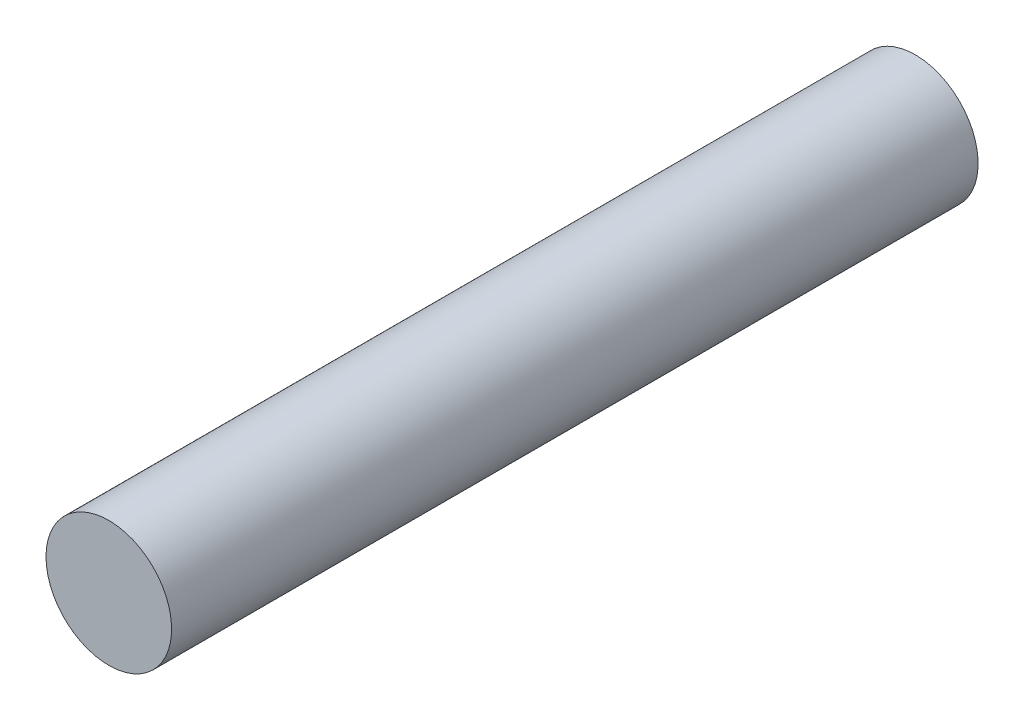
ISO-10303-21;
HEADER;
FILE_DESCRIPTION(('STEP AP214'),'2;1');
FILE_NAME('part.step','',(''),(''),'','','');
FILE_SCHEMA(('AUTOMOTIVE_DESIGN { 1 0 10303 214 1 1 1 1 }'));
ENDSEC;
DATA;
#1=APPLICATION_CONTEXT('core data for automotive mechanical design processes');
#2=APPLICATION_PROTOCOL_DEFINITION('international standard','automotive_design',2000,#1);
#3=PRODUCT_CONTEXT('',#1,'mechanical');
#4=PRODUCT('Part','Part','',(#3));
#5=PRODUCT_RELATED_PRODUCT_CATEGORY('part','',(#4));
#6=PRODUCT_DEFINITION_FORMATION('','',#4);
#7=PRODUCT_DEFINITION_CONTEXT('part definition',#1,'design');
#8=PRODUCT_DEFINITION('design','',#6,#7);
#9=PRODUCT_DEFINITION_SHAPE('','',#8);
#10=(LENGTH_UNIT() NAMED_UNIT(*) SI_UNIT(.MILLI.,.METRE.));
#11=(NAMED_UNIT(*) PLANE_ANGLE_UNIT() SI_UNIT($,.RADIAN.));
#12=(NAMED_UNIT(*) SI_UNIT($,.STERADIAN.) SOLID_ANGLE_UNIT());
#13=UNCERTAINTY_MEASURE_WITH_UNIT(LENGTH_MEASURE(1.E-05),#10,'distance_accuracy_value','');
#14=(GEOMETRIC_REPRESENTATION_CONTEXT(3) GLOBAL_UNCERTAINTY_ASSIGNED_CONTEXT((#13)) GLOBAL_UNIT_ASSIGNED_CONTEXT((#10,
#11,#12)) REPRESENTATION_CONTEXT('',''));
#15=CARTESIAN_POINT('',(0.,0.,0.));
#16=DIRECTION('',(0.,0.,1.));
#17=DIRECTION('',(1.,0.,0.));
#18=AXIS2_PLACEMENT_3D('',#15,#16,#17);
#19=CARTESIAN_POINT('',(0.,0.,122.));
#20=DIRECTION('',(0.,0.,-1.));
#21=DIRECTION('',(-1.,0.,0.));
#22=AXIS2_PLACEMENT_3D('',#19,#20,#21);
#23=CYLINDRICAL_SURFACE('',#22,9.5);
#24=CARTESIAN_POINT('',(0.,0.,122.));
#25=DIRECTION('',(0.,0.,1.));
#26=DIRECTION('',(1.,0.,0.));
#27=AXIS2_PLACEMENT_3D('',#24,#25,#26);
#28=CIRCLE('',#27,9.5);
#29=CARTESIAN_POINT('',(-9.5,0.,122.));
#30=VERTEX_POINT('',#29);
#31=EDGE_CURVE('E10',#30,#30,#28,.T.);
#32=CARTESIAN_POINT('',(0.,0.,0.));
#33=DIRECTION('',(0.,0.,1.));
#34=DIRECTION('',(1.,0.,0.));
#35=AXIS2_PLACEMENT_3D('',#32,#33,#34);
#36=CIRCLE('',#35,9.5);
#37=CARTESIAN_POINT('',(-9.5,0.,0.));
#38=VERTEX_POINT('',#37);
#39=EDGE_CURVE('E40',#38,#38,#36,.T.);
#40=CARTESIAN_POINT('',(-9.5,0.,122.));
#41=CARTESIAN_POINT('',(-9.5,0.,120.729166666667));
#42=CARTESIAN_POINT('',(-9.5,0.,119.458333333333));
#43=CARTESIAN_POINT('',(-9.5,0.,116.916666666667));
#44=CARTESIAN_POINT('',(-9.5,0.,115.645833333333));
#45=CARTESIAN_POINT('',(-9.5,0.,113.104166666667));
#46=CARTESIAN_POINT('',(-9.5,0.,111.833333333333));
#47=CARTESIAN_POINT('',(-9.5,0.,109.291666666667));
#48=CARTESIAN_POINT('',(-9.5,0.,108.020833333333));
#49=CARTESIAN_POINT('',(-9.5,0.,105.479166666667));
#50=CARTESIAN_POINT('',(-9.5,0.,104.208333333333));
#51=CARTESIAN_POINT('',(-9.5,0.,101.666666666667));
#52=CARTESIAN_POINT('',(-9.5,0.,100.395833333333));
#53=CARTESIAN_POINT('',(-9.5,0.,97.8541666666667));
#54=CARTESIAN_POINT('',(-9.5,0.,96.5833333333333));
#55=CARTESIAN_POINT('',(-9.5,0.,94.0416666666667));
#56=CARTESIAN_POINT('',(-9.5,0.,92.7708333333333));
#57=CARTESIAN_POINT('',(-9.5,0.,90.2291666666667));
#58=CARTESIAN_POINT('',(-9.5,0.,88.9583333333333));
#59=CARTESIAN_POINT('',(-9.5,0.,86.4166666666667));
#60=CARTESIAN_POINT('',(-9.5,0.,85.1458333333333));
#61=CARTESIAN_POINT('',(-9.5,0.,82.6041666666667));
#62=CARTESIAN_POINT('',(-9.5,0.,81.3333333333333));
#63=CARTESIAN_POINT('',(-9.5,0.,78.7916666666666));
#64=CARTESIAN_POINT('',(-9.5,0.,77.5208333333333));
#65=CARTESIAN_POINT('',(-9.5,0.,74.9791666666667));
#66=CARTESIAN_POINT('',(-9.5,0.,73.7083333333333));
#67=CARTESIAN_POINT('',(-9.5,0.,71.1666666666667));
#68=CARTESIAN_POINT('',(-9.5,0.,69.8958333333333));
#69=CARTESIAN_POINT('',(-9.5,0.,67.3541666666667));
#70=CARTESIAN_POINT('',(-9.5,0.,66.0833333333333));
#71=CARTESIAN_POINT('',(-9.5,0.,63.5416666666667));
#72=CARTESIAN_POINT('',(-9.5,0.,62.2708333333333));
#73=CARTESIAN_POINT('',(-9.5,0.,59.7291666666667));
#74=CARTESIAN_POINT('',(-9.5,0.,58.4583333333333));
#75=CARTESIAN_POINT('',(-9.5,0.,55.9166666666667));
#76=CARTESIAN_POINT('',(-9.5,0.,54.6458333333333));
#77=CARTESIAN_POINT('',(-9.5,0.,52.1041666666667));
#78=CARTESIAN_POINT('',(-9.5,0.,50.8333333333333));
#79=CARTESIAN_POINT('',(-9.5,0.,48.2916666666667));
#80=CARTESIAN_POINT('',(-9.5,0.,47.0208333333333));
#81=CARTESIAN_POINT('',(-9.5,0.,44.4791666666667));
#82=CARTESIAN_POINT('',(-9.5,0.,43.2083333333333));
#83=CARTESIAN_POINT('',(-9.5,0.,40.6666666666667));
#84=CARTESIAN_POINT('',(-9.5,0.,39.3958333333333));
#85=CARTESIAN_POINT('',(-9.5,0.,36.8541666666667));
#86=CARTESIAN_POINT('',(-9.5,0.,35.5833333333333));
#87=CARTESIAN_POINT('',(-9.5,0.,33.0416666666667));
#88=CARTESIAN_POINT('',(-9.5,0.,31.7708333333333));
#89=CARTESIAN_POINT('',(-9.5,0.,29.2291666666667));
#90=CARTESIAN_POINT('',(-9.5,0.,27.9583333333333));
#91=CARTESIAN_POINT('',(-9.5,0.,25.4166666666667));
#92=CARTESIAN_POINT('',(-9.5,0.,24.1458333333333));
#93=CARTESIAN_POINT('',(-9.5,0.,21.6041666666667));
#94=CARTESIAN_POINT('',(-9.5,0.,20.3333333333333));
#95=CARTESIAN_POINT('',(-9.5,0.,17.7916666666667));
#96=CARTESIAN_POINT('',(-9.5,0.,16.5208333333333));
#97=CARTESIAN_POINT('',(-9.5,0.,13.9791666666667));
#98=CARTESIAN_POINT('',(-9.5,0.,12.7083333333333));
#99=CARTESIAN_POINT('',(-9.5,0.,10.1666666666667));
#100=CARTESIAN_POINT('',(-9.5,0.,8.89583333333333));
#101=CARTESIAN_POINT('',(-9.5,0.,6.35416666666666));
#102=CARTESIAN_POINT('',(-9.5,0.,5.08333333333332));
#103=CARTESIAN_POINT('',(-9.5,0.,2.54166666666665));
#104=CARTESIAN_POINT('',(-9.5,0.,1.27083333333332));
#105=CARTESIAN_POINT('',(-9.5,0.,0.));
#106=B_SPLINE_CURVE_WITH_KNOTS('',3,(#40,#41,#42,#43,#44,#45,#46,#47,#48,#49,#50,#51,#52,#53,
#54,#55,#56,#57,#58,#59,#60,#61,#62,#63,#64,#65,#66,#67,#68,#69,#70,#71,#72,#73,#74,#75,#76,#77,
#78,#79,#80,#81,#82,#83,#84,#85,#86,#87,#88,#89,#90,#91,#92,#93,#94,#95,#96,#97,#98,#99,#100,
#101,#102,#103,#104,#105),.UNSPECIFIED.,.F.,.F.,(4,2,2,2,2,2,2,2,2,2,2,2,2,2,2,2,2,2,2,2,2,2,2,
2,2,2,2,2,2,2,2,2,4),(0.,3.81250000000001,7.62500000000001,11.4375,15.25,19.0625,22.875,26.6875,
30.5,34.3125,38.125,41.9375,45.75,49.5625,53.375,57.1875,61.,64.8125,68.625,72.4375,76.25,
80.0625,83.875,87.6875,91.5,95.3125,99.125,102.9375,106.75,110.5625,114.375,118.1875,122.),.UNSPECIFIED.);
#107=EDGE_CURVE('BSEAM37',#30,#38,#106,.T.);
#108=ORIENTED_EDGE('',*,*,#31,.F.);
#109=ORIENTED_EDGE('',*,*,#39,.T.);
#110=ORIENTED_EDGE('',*,*,#107,.T.);
#111=ORIENTED_EDGE('',*,*,#107,.F.);
#112=EDGE_LOOP('',(#108,#110,#109,#111));
#113=FACE_BOUND('',#112,.T.);
#114=ADVANCED_FACE('F37',(#113),#23,.T.);
#115=CARTESIAN_POINT('',(0.,0.,122.));
#116=DIRECTION('',(0.,0.,1.));
#117=DIRECTION('',(1.,0.,0.));
#118=AXIS2_PLACEMENT_3D('',#115,#116,#117);
#119=PLANE('',#118);
#120=ORIENTED_EDGE('',*,*,#31,.T.);
#121=EDGE_LOOP('',(#120));
#122=FACE_BOUND('',#121,.T.);
#123=ADVANCED_FACE('F54',(#122),#119,.T.);
#124=CARTESIAN_POINT('',(0.,0.,0.));
#125=DIRECTION('',(0.,0.,1.));
#126=DIRECTION('',(1.,0.,0.));
#127=AXIS2_PLACEMENT_3D('',#124,#125,#126);
#128=PLANE('',#127);
#129=ORIENTED_EDGE('',*,*,#39,.F.);
#130=EDGE_LOOP('',(#129));
#131=FACE_BOUND('',#130,.T.);
#132=ADVANCED_FACE('F52',(#131),#128,.F.);
#133=CLOSED_SHELL('',(#114,#123,#132));
#134=MANIFOLD_SOLID_BREP('B2',#133);
#135=ADVANCED_BREP_SHAPE_REPRESENTATION('',(#18,#134),#14);
#136=SHAPE_DEFINITION_REPRESENTATION(#9,#135);
ENDSEC;
END-ISO-10303-21;
